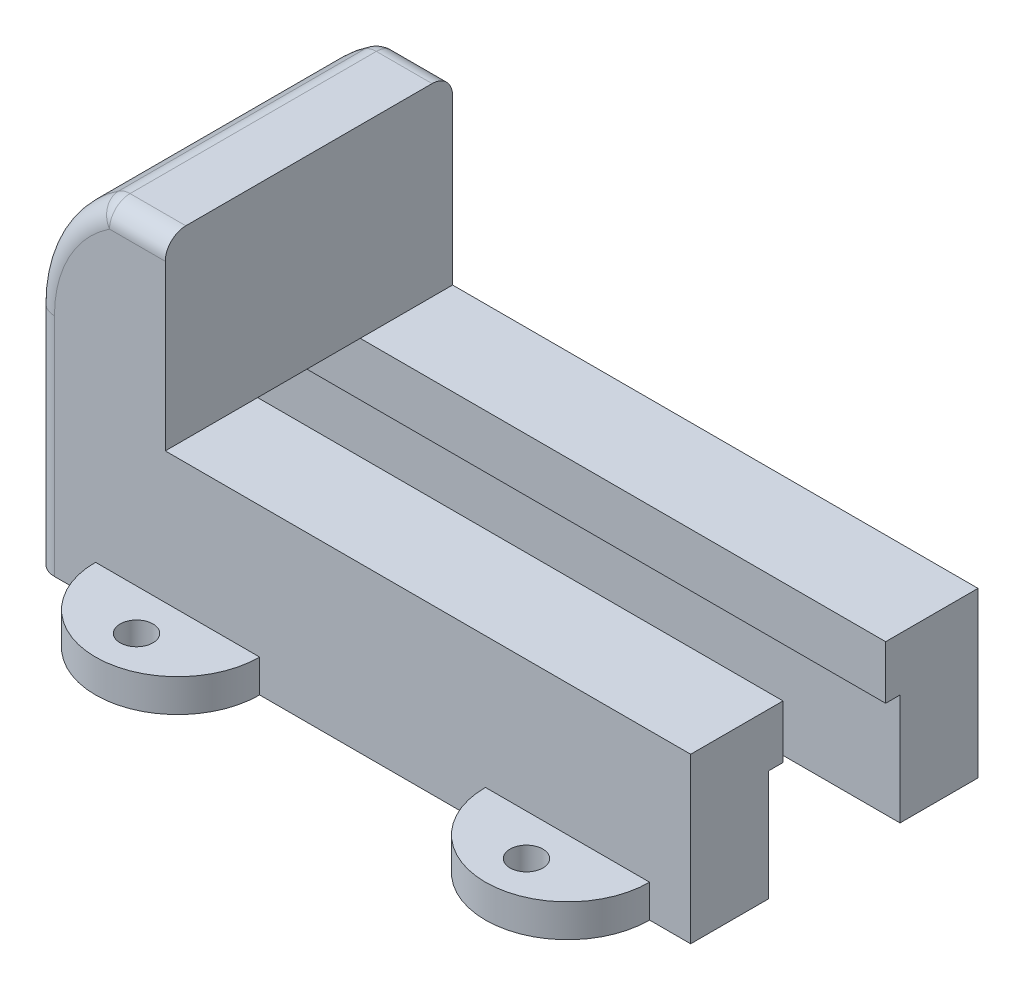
from build123d import *

# Parameters (mm, degrees)
SKETCH1_W                      = 185
SKETCH1_H                      = 40
EXTRUDE1_DEPTH                 = 35
EXTRUDE2_DEPTH                 = 70
EXTRUDE3_DEPTH                 = 25
CUT_EXTRUDE1_DEPTH             = 207.579282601
EXTRUDE4_DEPTH                 = 8
EXTRUDE5_DEPTH                 = 8
F_8_0_8_DIAMETER_HOLE1_D       = 8
F_14_0_14_DIAMETER_HOLE1_D     = 14
F_14_0_14_DIAMETER_HOLE1_DEPTH = 25
FILLET3_R                      = 2
FILLET10_R                     = 5
CUT_EXTRUDE2_DEPTH             = 223.598292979
CUT_EXTRUDE2_DEPTH_BACK        = 223.598292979


with BuildPart() as part:
    # Sketch1 → Extrude1 (new, symmetric)
    with BuildSketch(Plane.XY):
        with Locations((92.5, 20)):
            Rectangle(SKETCH1_W, SKETCH1_H)
    extrude(amount=EXTRUDE1_DEPTH, both=True)

    # Sketch2 → Extrude2 (add)
    with BuildSketch(Plane.XY.offset(35)):
        with BuildLine():
            Line((0, 40), (32, 40))
            Line((32, 40), (32, 85))
            Line((32, 85), (16.972243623, 85))
            ThreePointArc((16.972243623, 85), (4.537141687, 72.234101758), (0, 55))
            Line((0, 55), (0, 40))
        make_face()
    extrude(amount=-EXTRUDE2_DEPTH)

    # Sketch3 → Extrude3 (add)
    with BuildSketch(Plane(origin=(185, 0, 0), x_dir=(0, 0, -1), z_dir=(1, 0, 0))):
        with BuildLine():
            Line((-35, 40), (35, 40))
            Line((35, 40), (35, 55))
            Line((35, 55), (17, 55))
            ThreePointArc((17, 55), (0, 72), (-17, 55))
            Line((-17, 55), (-35, 55))
            Line((-35, 55), (-35, 40))
        make_face()
    extrude(amount=-EXTRUDE3_DEPTH)

    # Sketch4 → Cut-Extrude1 (cut, through all)
    with BuildSketch(Plane(origin=(185, 0, 0), x_dir=(0, 0, -1), z_dir=(1, 0, 0))):
        Polygon((-16, 0), (16, 0), (16, 27), (12.5, 27), (12.5, 40), (-12.5, 40), (-12.5, 27), (-16, 27), align=None)
    extrude(amount=-CUT_EXTRUDE1_DEPTH, mode=Mode.SUBTRACT)

    # Sketch5 → Extrude4 (add)
    with BuildSketch(Plane.XZ):
        with BuildLine():
            Line((15, 35), (55, 35))
            ThreePointArc((55, 35), (35, 55), (15, 35))
        make_face()
    extrude4 = extrude(amount=-EXTRUDE4_DEPTH)

    # Sketch6 → Extrude5 (add)
    with BuildSketch(Plane.XZ):
        with BuildLine():
            Line((110, 35), (150, 35))
            ThreePointArc((150, 35), (130, 55), (110, 35))
        make_face()
    extrude5 = extrude(amount=-EXTRUDE5_DEPTH)

    # Mirror1: Extrude4, Extrude5 across plane
    add(extrude4.mirror(Plane.XY))
    add(extrude5.mirror(Plane.XY))

    # 8.0 _8_ Diameter Hole1 (through all)
    with Locations(Plane(origin=(0, 8, 0), x_dir=(-1, 0, 0), z_dir=(0, 1, 0))):
        with Locations((-35, 45), (-130, 45), (-35, -45), (-130, -45)):
            Hole(F_8_0_8_DIAMETER_HOLE1_D / 2)

    # 14.0 _14_ Diameter Hole1
    with Locations(Plane(origin=(185, 0, 0), x_dir=(0, 0, -1), z_dir=(1, 0, 0))):
        with Locations((0, 55)):
            Hole(F_14_0_14_DIAMETER_HOLE1_D / 2, depth=F_14_0_14_DIAMETER_HOLE1_DEPTH)

    # Fillet3
    fillet3_edges = [part.edges().sort_by_distance(p)[0] for p in [
        (185, 55, 26),
    ]]
    fillet(fillet3_edges, radius=FILLET3_R)

    # Fillet10
    fillet10_edges = [part.edges().sort_by_distance(p)[0] for p in [
        (4.537141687, 72.234101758, -35),
        (24.486121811, 85, -35),
        (16.972243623, 85, 0),
        (24.486121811, 85, 35),
        (4.537141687, 72.234101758, 35),
        (0, 27.5, 35),
        (0, 27.5, -35),
    ]]
    fillet(fillet10_edges, radius=FILLET10_R)

    # Sketch12 → Cut-Extrude2 (cut, two sides: drawn at the far end of the back side and taken through both)
    with BuildSketch(Plane.XY.offset(35).offset(-CUT_EXTRUDE2_DEPTH_BACK)):
        Polygon((160, 475.924423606), (160, 86.777149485), (160, -16.676761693), (160, -405.824035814), (938.294548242, -405.824035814), (938.294548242, 475.924423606), align=None)
    extrude(amount=CUT_EXTRUDE2_DEPTH + CUT_EXTRUDE2_DEPTH_BACK, mode=Mode.SUBTRACT)


solid = part.part
